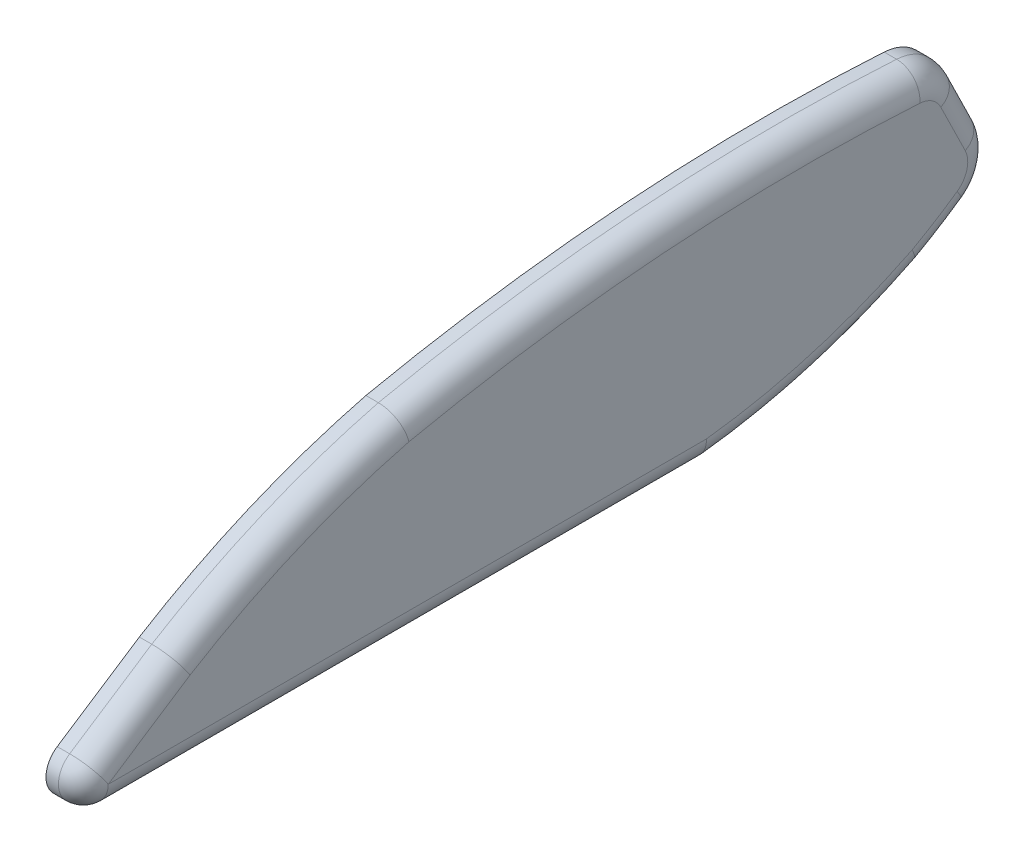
ISO-10303-21;
HEADER;
FILE_DESCRIPTION(('STEP AP214'),'2;1');
FILE_NAME('part.step','',(''),(''),'','','');
FILE_SCHEMA(('AUTOMOTIVE_DESIGN { 1 0 10303 214 1 1 1 1 }'));
ENDSEC;
DATA;
#1=APPLICATION_CONTEXT('core data for automotive mechanical design processes');
#2=APPLICATION_PROTOCOL_DEFINITION('international standard','automotive_design',2000,#1);
#3=PRODUCT_CONTEXT('',#1,'mechanical');
#4=PRODUCT('Part','Part','',(#3));
#5=PRODUCT_RELATED_PRODUCT_CATEGORY('part','',(#4));
#6=PRODUCT_DEFINITION_FORMATION('','',#4);
#7=PRODUCT_DEFINITION_CONTEXT('part definition',#1,'design');
#8=PRODUCT_DEFINITION('design','',#6,#7);
#9=PRODUCT_DEFINITION_SHAPE('','',#8);
#10=(LENGTH_UNIT() NAMED_UNIT(*) SI_UNIT(.MILLI.,.METRE.));
#11=(NAMED_UNIT(*) PLANE_ANGLE_UNIT() SI_UNIT($,.RADIAN.));
#12=(NAMED_UNIT(*) SI_UNIT($,.STERADIAN.) SOLID_ANGLE_UNIT());
#13=UNCERTAINTY_MEASURE_WITH_UNIT(LENGTH_MEASURE(1.E-05),#10,'distance_accuracy_value','');
#14=(GEOMETRIC_REPRESENTATION_CONTEXT(3) GLOBAL_UNCERTAINTY_ASSIGNED_CONTEXT((#13)) GLOBAL_UNIT_ASSIGNED_CONTEXT((#10,
#11,#12)) REPRESENTATION_CONTEXT('',''));
#15=CARTESIAN_POINT('',(0.,0.,0.));
#16=DIRECTION('',(0.,0.,1.));
#17=DIRECTION('',(1.,0.,0.));
#18=AXIS2_PLACEMENT_3D('',#15,#16,#17);
#19=CARTESIAN_POINT('',(15.,5142.50289528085,-13454.2735587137));
#20=DIRECTION('',(-1.,0.,0.));
#21=DIRECTION('',(0.,0.,1.));
#22=AXIS2_PLACEMENT_3D('',#19,#20,#21);
#23=CYLINDRICAL_SURFACE('',#22,9.99999999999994);
#24=DIRECTION('',(-1.,0.,0.));
#25=VECTOR('',#24,1.);
#26=CARTESIAN_POINT('',(15.,5132.50289528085,-13454.2735587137));
#27=LINE('',#26,#25);
#28=CARTESIAN_POINT('',(5.,5132.50289528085,-13454.2735587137));
#29=VERTEX_POINT('',#28);
#30=CARTESIAN_POINT('',(0.,5132.50289528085,-13454.2735587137));
#31=VERTEX_POINT('',#30);
#32=EDGE_CURVE('E138',#29,#31,#27,.T.);
#33=ORIENTED_EDGE('',*,*,#32,.F.);
#34=CARTESIAN_POINT('',(5.,5142.50289528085,-13454.2735587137));
#35=DIRECTION('',(-1.,0.,0.));
#36=DIRECTION('',(0.,0.,1.));
#37=AXIS2_PLACEMENT_3D('',#34,#35,#36);
#38=CIRCLE('',#37,9.99999999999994);
#39=CARTESIAN_POINT('',(5.,5150.86365337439,-13448.7874194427));
#40=VERTEX_POINT('',#39);
#41=EDGE_CURVE('E11',#29,#40,#38,.T.);
#42=ORIENTED_EDGE('',*,*,#41,.T.);
#43=DIRECTION('',(-1.,0.,0.));
#44=VECTOR('',#43,1.);
#45=CARTESIAN_POINT('',(15.,5150.86365337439,-13448.7874194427));
#46=LINE('',#45,#44);
#47=CARTESIAN_POINT('',(0.,5150.86365337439,-13448.7874194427));
#48=VERTEX_POINT('',#47);
#49=EDGE_CURVE('E159',#40,#48,#46,.T.);
#50=ORIENTED_EDGE('',*,*,#49,.T.);
#51=CARTESIAN_POINT('',(0.,5142.50289528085,-13454.2735587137));
#52=DIRECTION('',(1.,0.,0.));
#53=DIRECTION('',(0.,0.,-1.));
#54=AXIS2_PLACEMENT_3D('',#51,#52,#53);
#55=CIRCLE('',#54,9.99999999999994);
#56=EDGE_CURVE('E153',#48,#31,#55,.T.);
#57=ORIENTED_EDGE('',*,*,#56,.T.);
#58=EDGE_LOOP('',(#33,#42,#50,#57));
#59=FACE_BOUND('',#58,.T.);
#60=ADVANCED_FACE('F35',(#59),#23,.T.);
#61=CARTESIAN_POINT('',(15.,5132.50289528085,-13454.2735587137));
#62=DIRECTION('',(0.,1.,0.));
#63=DIRECTION('',(0.,0.,1.));
#64=AXIS2_PLACEMENT_3D('',#61,#62,#63);
#65=PLANE('',#64);
#66=DIRECTION('',(-1.,0.,0.));
#67=VECTOR('',#66,1.);
#68=CARTESIAN_POINT('',(15.,5132.50289528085,-13695.0821016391));
#69=LINE('',#68,#67);
#70=CARTESIAN_POINT('',(5.,5132.50289528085,-13695.0821016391));
#71=VERTEX_POINT('',#70);
#72=CARTESIAN_POINT('',(0.,5132.50289528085,-13695.0821016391));
#73=VERTEX_POINT('',#72);
#74=EDGE_CURVE('E147',#71,#73,#69,.T.);
#75=ORIENTED_EDGE('',*,*,#74,.F.);
#76=DIRECTION('',(0.,0.,-1.));
#77=VECTOR('',#76,1.);
#78=CARTESIAN_POINT('',(5.,5132.50289528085,-13454.2735587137));
#79=LINE('',#78,#77);
#80=EDGE_CURVE('E44',#71,#29,#79,.F.);
#81=ORIENTED_EDGE('',*,*,#80,.T.);
#82=ORIENTED_EDGE('',*,*,#32,.T.);
#83=DIRECTION('',(0.,0.,-1.));
#84=VECTOR('',#83,1.);
#85=CARTESIAN_POINT('',(0.,5132.50289528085,-13454.2735587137));
#86=LINE('',#85,#84);
#87=EDGE_CURVE('E141',#31,#73,#86,.T.);
#88=ORIENTED_EDGE('',*,*,#87,.T.);
#89=EDGE_LOOP('',(#75,#81,#82,#88));
#90=FACE_BOUND('',#89,.T.);
#91=ADVANCED_FACE('F140',(#90),#65,.F.);
#92=CARTESIAN_POINT('',(15.,5391.39881240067,-13665.8801747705));
#93=DIRECTION('',(-1.,0.,0.));
#94=DIRECTION('',(0.,0.,1.));
#95=AXIS2_PLACEMENT_3D('',#92,#93,#94);
#96=CYLINDRICAL_SURFACE('',#95,260.537614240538);
#97=DIRECTION('',(-1.,0.,0.));
#98=VECTOR('',#97,1.);
#99=CARTESIAN_POINT('',(15.,5158.06773013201,-13781.79589623));
#100=LINE('',#99,#98);
#101=CARTESIAN_POINT('',(5.,5158.06773013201,-13781.79589623));
#102=VERTEX_POINT('',#101);
#103=CARTESIAN_POINT('',(0.,5158.06773013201,-13781.79589623));
#104=VERTEX_POINT('',#103);
#105=EDGE_CURVE('E199',#102,#104,#100,.T.);
#106=ORIENTED_EDGE('',*,*,#105,.F.);
#107=CARTESIAN_POINT('',(5.,5391.39881240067,-13665.8801747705));
#108=DIRECTION('',(1.,0.,0.));
#109=DIRECTION('',(0.,0.,-1.));
#110=AXIS2_PLACEMENT_3D('',#107,#108,#109);
#111=CIRCLE('',#110,260.537614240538);
#112=EDGE_CURVE('E59',#102,#71,#111,.F.);
#113=ORIENTED_EDGE('',*,*,#112,.T.);
#114=ORIENTED_EDGE('',*,*,#74,.T.);
#115=CARTESIAN_POINT('',(0.,5391.39881240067,-13665.8801747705));
#116=DIRECTION('',(1.,0.,0.));
#117=DIRECTION('',(0.,0.,-1.));
#118=AXIS2_PLACEMENT_3D('',#115,#116,#117);
#119=CIRCLE('',#118,260.537614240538);
#120=EDGE_CURVE('E156',#73,#104,#119,.T.);
#121=ORIENTED_EDGE('',*,*,#120,.T.);
#122=EDGE_LOOP('',(#106,#113,#114,#121));
#123=FACE_BOUND('',#122,.T.);
#124=ADVANCED_FACE('F367',(#123),#96,.T.);
#125=CARTESIAN_POINT('',(15.,5346.77737093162,-13677.4696435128));
#126=DIRECTION('',(-1.,0.,0.));
#127=DIRECTION('',(0.,0.,1.));
#128=AXIS2_PLACEMENT_3D('',#125,#126,#127);
#129=CYLINDRICAL_SURFACE('',#128,215.627678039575);
#130=DIRECTION('',(-1.,0.,0.));
#131=VECTOR('',#130,1.);
#132=CARTESIAN_POINT('',(15.,5170.02673681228,-13800.9787884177));
#133=LINE('',#132,#131);
#134=CARTESIAN_POINT('',(5.,5170.02673681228,-13800.9787884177));
#135=VERTEX_POINT('',#134);
#136=CARTESIAN_POINT('',(0.,5170.02673681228,-13800.9787884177));
#137=VERTEX_POINT('',#136);
#138=EDGE_CURVE('E197',#135,#137,#133,.T.);
#139=ORIENTED_EDGE('',*,*,#138,.F.);
#140=CARTESIAN_POINT('',(5.,5346.77737093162,-13677.4696435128));
#141=DIRECTION('',(1.,0.,0.));
#142=DIRECTION('',(0.,0.,-1.));
#143=AXIS2_PLACEMENT_3D('',#140,#141,#142);
#144=CIRCLE('',#143,215.627678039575);
#145=EDGE_CURVE('E233',#135,#102,#144,.F.);
#146=ORIENTED_EDGE('',*,*,#145,.T.);
#147=ORIENTED_EDGE('',*,*,#105,.T.);
#148=CARTESIAN_POINT('',(0.,5346.77737093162,-13677.4696435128));
#149=DIRECTION('',(1.,0.,0.));
#150=DIRECTION('',(0.,0.,-1.));
#151=AXIS2_PLACEMENT_3D('',#148,#149,#150);
#152=CIRCLE('',#151,215.627678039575);
#153=EDGE_CURVE('E166',#104,#137,#152,.T.);
#154=ORIENTED_EDGE('',*,*,#153,.T.);
#155=EDGE_LOOP('',(#139,#146,#147,#154));
#156=FACE_BOUND('',#155,.T.);
#157=ADVANCED_FACE('F372',(#156),#129,.T.);
#158=CARTESIAN_POINT('',(15.,5186.42079491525,-13789.5230100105));
#159=DIRECTION('',(-1.,0.,0.));
#160=DIRECTION('',(0.,0.,1.));
#161=AXIS2_PLACEMENT_3D('',#158,#159,#160);
#162=CYLINDRICAL_SURFACE('',#161,20.0000000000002);
#163=DIRECTION('',(-1.,0.,0.));
#164=VECTOR('',#163,1.);
#165=CARTESIAN_POINT('',(15.,5195.2187907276,-13807.4839473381));
#166=LINE('',#165,#164);
#167=CARTESIAN_POINT('',(5.,5195.2187907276,-13807.4839473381));
#168=VERTEX_POINT('',#167);
#169=CARTESIAN_POINT('',(0.,5195.2187907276,-13807.4839473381));
#170=VERTEX_POINT('',#169);
#171=EDGE_CURVE('E195',#168,#170,#166,.T.);
#172=ORIENTED_EDGE('',*,*,#171,.F.);
#173=CARTESIAN_POINT('',(5.,5186.42079491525,-13789.5230100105));
#174=DIRECTION('',(1.,0.,0.));
#175=DIRECTION('',(0.,0.,-1.));
#176=AXIS2_PLACEMENT_3D('',#173,#174,#175);
#177=CIRCLE('',#176,20.0000000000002);
#178=EDGE_CURVE('E231',#168,#135,#177,.F.);
#179=ORIENTED_EDGE('',*,*,#178,.T.);
#180=ORIENTED_EDGE('',*,*,#138,.T.);
#181=CARTESIAN_POINT('',(0.,5186.42079491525,-13789.5230100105));
#182=DIRECTION('',(1.,0.,0.));
#183=DIRECTION('',(0.,0.,-1.));
#184=AXIS2_PLACEMENT_3D('',#181,#182,#183);
#185=CIRCLE('',#184,20.0000000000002);
#186=EDGE_CURVE('E169',#137,#170,#185,.T.);
#187=ORIENTED_EDGE('',*,*,#186,.T.);
#188=EDGE_LOOP('',(#172,#179,#180,#187));
#189=FACE_BOUND('',#188,.T.);
#190=ADVANCED_FACE('F375',(#189),#162,.T.);
#191=CARTESIAN_POINT('',(15.,5215.23278953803,-13797.6802787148));
#192=DIRECTION('',(0.,-0.439899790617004,0.898046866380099));
#193=DIRECTION('',(0.,-0.898046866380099,-0.439899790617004));
#194=AXIS2_PLACEMENT_3D('',#191,#192,#193);
#195=PLANE('',#194);
#196=DIRECTION('',(-1.,0.,0.));
#197=VECTOR('',#196,1.);
#198=CARTESIAN_POINT('',(15.,5215.23278953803,-13797.6802787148));
#199=LINE('',#198,#197);
#200=CARTESIAN_POINT('',(5.,5215.23278953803,-13797.6802787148));
#201=VERTEX_POINT('',#200);
#202=CARTESIAN_POINT('',(0.,5215.23278953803,-13797.6802787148));
#203=VERTEX_POINT('',#202);
#204=EDGE_CURVE('E193',#201,#203,#199,.T.);
#205=ORIENTED_EDGE('',*,*,#204,.F.);
#206=DIRECTION('',(0.,0.898046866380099,0.439899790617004));
#207=VECTOR('',#206,1.);
#208=CARTESIAN_POINT('',(5.,5195.2187907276,-13807.4839473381));
#209=LINE('',#208,#207);
#210=EDGE_CURVE('E229',#201,#168,#209,.F.);
#211=ORIENTED_EDGE('',*,*,#210,.T.);
#212=ORIENTED_EDGE('',*,*,#171,.T.);
#213=DIRECTION('',(0.,0.898046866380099,0.439899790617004));
#214=VECTOR('',#213,1.);
#215=CARTESIAN_POINT('',(0.,5215.23278953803,-13797.6802787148));
#216=LINE('',#215,#214);
#217=EDGE_CURVE('E172',#170,#203,#216,.T.);
#218=ORIENTED_EDGE('',*,*,#217,.T.);
#219=EDGE_LOOP('',(#205,#211,#212,#218));
#220=FACE_BOUND('',#219,.T.);
#221=ADVANCED_FACE('F351',(#220),#195,.F.);
#222=CARTESIAN_POINT('',(15.,5206.43479372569,-13779.7193413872));
#223=DIRECTION('',(-1.,0.,0.));
#224=DIRECTION('',(0.,0.,1.));
#225=AXIS2_PLACEMENT_3D('',#222,#223,#224);
#226=CYLINDRICAL_SURFACE('',#225,19.9999999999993);
#227=DIRECTION('',(-1.,0.,0.));
#228=VECTOR('',#227,1.);
#229=CARTESIAN_POINT('',(15.,5226.39702323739,-13780.9479149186));
#230=LINE('',#229,#228);
#231=CARTESIAN_POINT('',(5.,5226.39702323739,-13780.9479149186));
#232=VERTEX_POINT('',#231);
#233=CARTESIAN_POINT('',(0.,5226.39702323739,-13780.9479149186));
#234=VERTEX_POINT('',#233);
#235=EDGE_CURVE('E191',#232,#234,#230,.T.);
#236=ORIENTED_EDGE('',*,*,#235,.F.);
#237=CARTESIAN_POINT('',(5.,5206.43479372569,-13779.7193413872));
#238=DIRECTION('',(1.,0.,0.));
#239=DIRECTION('',(0.,0.,-1.));
#240=AXIS2_PLACEMENT_3D('',#237,#238,#239);
#241=CIRCLE('',#240,19.9999999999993);
#242=EDGE_CURVE('E227',#232,#201,#241,.F.);
#243=ORIENTED_EDGE('',*,*,#242,.T.);
#244=ORIENTED_EDGE('',*,*,#204,.T.);
#245=CARTESIAN_POINT('',(0.,5206.43479372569,-13779.7193413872));
#246=DIRECTION('',(1.,0.,0.));
#247=DIRECTION('',(0.,0.,-1.));
#248=AXIS2_PLACEMENT_3D('',#245,#246,#247);
#249=CIRCLE('',#248,19.9999999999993);
#250=EDGE_CURVE('E175',#203,#234,#249,.T.);
#251=ORIENTED_EDGE('',*,*,#250,.T.);
#252=EDGE_LOOP('',(#236,#243,#244,#251));
#253=FACE_BOUND('',#252,.T.);
#254=ADVANCED_FACE('F348',(#253),#226,.T.);
#255=CARTESIAN_POINT('',(15.,4453.86792841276,-13733.4026846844));
#256=DIRECTION('',(-1.,0.,0.));
#257=DIRECTION('',(0.,0.,1.));
#258=AXIS2_PLACEMENT_3D('',#255,#256,#257);
#259=CYLINDRICAL_SURFACE('',#258,773.990795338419);
#260=DIRECTION('',(-1.,0.,0.));
#261=VECTOR('',#260,1.);
#262=CARTESIAN_POINT('',(15.,5211.00677382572,-13572.7710563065));
#263=LINE('',#262,#261);
#264=CARTESIAN_POINT('',(5.,5211.00677382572,-13572.7710563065));
#265=VERTEX_POINT('',#264);
#266=CARTESIAN_POINT('',(0.,5211.00677382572,-13572.7710563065));
#267=VERTEX_POINT('',#266);
#268=EDGE_CURVE('E189',#265,#267,#263,.T.);
#269=ORIENTED_EDGE('',*,*,#268,.F.);
#270=CARTESIAN_POINT('',(5.,4453.86792841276,-13733.4026846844));
#271=DIRECTION('',(1.,0.,0.));
#272=DIRECTION('',(0.,0.,-1.));
#273=AXIS2_PLACEMENT_3D('',#270,#271,#272);
#274=CIRCLE('',#273,773.990795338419);
#275=EDGE_CURVE('E225',#265,#232,#274,.F.);
#276=ORIENTED_EDGE('',*,*,#275,.T.);
#277=ORIENTED_EDGE('',*,*,#235,.T.);
#278=CARTESIAN_POINT('',(0.,4453.86792841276,-13733.4026846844));
#279=DIRECTION('',(1.,0.,0.));
#280=DIRECTION('',(0.,0.,-1.));
#281=AXIS2_PLACEMENT_3D('',#278,#279,#280);
#282=CIRCLE('',#281,773.990795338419);
#283=EDGE_CURVE('E178',#234,#267,#282,.T.);
#284=ORIENTED_EDGE('',*,*,#283,.T.);
#285=EDGE_LOOP('',(#269,#276,#277,#284));
#286=FACE_BOUND('',#285,.T.);
#287=ADVANCED_FACE('F336',(#286),#259,.T.);
#288=CARTESIAN_POINT('',(15.,4894.62531357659,-13652.9812665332));
#289=DIRECTION('',(-1.,0.,0.));
#290=DIRECTION('',(0.,0.,1.));
#291=AXIS2_PLACEMENT_3D('',#288,#289,#290);
#292=CYLINDRICAL_SURFACE('',#291,326.390726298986);
#293=DIRECTION('',(-1.,0.,0.));
#294=VECTOR('',#293,1.);
#295=CARTESIAN_POINT('',(15.,5172.50289528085,-13481.7651580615));
#296=LINE('',#295,#294);
#297=CARTESIAN_POINT('',(5.,5172.50289528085,-13481.7651580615));
#298=VERTEX_POINT('',#297);
#299=CARTESIAN_POINT('',(0.,5172.50289528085,-13481.7651580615));
#300=VERTEX_POINT('',#299);
#301=EDGE_CURVE('E187',#298,#300,#296,.T.);
#302=ORIENTED_EDGE('',*,*,#301,.F.);
#303=CARTESIAN_POINT('',(5.,4894.62531357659,-13652.9812665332));
#304=DIRECTION('',(1.,0.,0.));
#305=DIRECTION('',(0.,0.,-1.));
#306=AXIS2_PLACEMENT_3D('',#303,#304,#305);
#307=CIRCLE('',#306,326.390726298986);
#308=EDGE_CURVE('E223',#298,#265,#307,.F.);
#309=ORIENTED_EDGE('',*,*,#308,.T.);
#310=ORIENTED_EDGE('',*,*,#268,.T.);
#311=CARTESIAN_POINT('',(0.,4894.62531357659,-13652.9812665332));
#312=DIRECTION('',(1.,0.,0.));
#313=DIRECTION('',(0.,0.,-1.));
#314=AXIS2_PLACEMENT_3D('',#311,#312,#313);
#315=CIRCLE('',#314,326.390726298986);
#316=EDGE_CURVE('E181',#267,#300,#315,.T.);
#317=ORIENTED_EDGE('',*,*,#316,.T.);
#318=EDGE_LOOP('',(#302,#309,#310,#317));
#319=FACE_BOUND('',#318,.T.);
#320=ADVANCED_FACE('F333',(#319),#292,.T.);
#321=CARTESIAN_POINT('',(15.,5150.86365337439,-13448.7874194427));
#322=DIRECTION('',(0.,-0.836075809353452,-0.548613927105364));
#323=DIRECTION('',(0.,0.548613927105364,-0.836075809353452));
#324=AXIS2_PLACEMENT_3D('',#321,#322,#323);
#325=PLANE('',#324);
#326=ORIENTED_EDGE('',*,*,#49,.F.);
#327=DIRECTION('',(0.,-0.548613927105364,0.836075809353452));
#328=VECTOR('',#327,1.);
#329=CARTESIAN_POINT('',(5.,5172.50289528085,-13481.7651580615));
#330=LINE('',#329,#328);
#331=EDGE_CURVE('E220',#40,#298,#330,.F.);
#332=ORIENTED_EDGE('',*,*,#331,.T.);
#333=ORIENTED_EDGE('',*,*,#301,.T.);
#334=DIRECTION('',(0.,-0.548613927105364,0.836075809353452));
#335=VECTOR('',#334,1.);
#336=CARTESIAN_POINT('',(0.,5150.86365337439,-13448.7874194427));
#337=LINE('',#336,#335);
#338=EDGE_CURVE('E184',#300,#48,#337,.T.);
#339=ORIENTED_EDGE('',*,*,#338,.T.);
#340=EDGE_LOOP('',(#326,#332,#333,#339));
#341=FACE_BOUND('',#340,.T.);
#342=ADVANCED_FACE('F323',(#341),#325,.F.);
#343=CARTESIAN_POINT('',(15.,5142.50289528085,-13454.2735587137));
#344=DIRECTION('',(1.,0.,0.));
#345=DIRECTION('',(0.,0.,-1.));
#346=AXIS2_PLACEMENT_3D('',#343,#344,#345);
#347=PLANE('',#346);
#348=CARTESIAN_POINT('',(15.,4894.62531357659,-13652.9812665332));
#349=DIRECTION('',(1.,0.,0.));
#350=DIRECTION('',(0.,0.,-1.));
#351=AXIS2_PLACEMENT_3D('',#348,#349,#350);
#352=CIRCLE('',#351,316.390726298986);
#353=CARTESIAN_POINT('',(15.,5201.26538139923,-13575.0392336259));
#354=VERTEX_POINT('',#353);
#355=CARTESIAN_POINT('',(15.,5164.06337161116,-13487.1312602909));
#356=VERTEX_POINT('',#355);
#357=EDGE_CURVE('E215',#354,#356,#352,.T.);
#358=ORIENTED_EDGE('',*,*,#357,.T.);
#359=DIRECTION('',(0.,-0.548613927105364,0.836075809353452));
#360=VECTOR('',#359,1.);
#361=CARTESIAN_POINT('',(15.,5142.50289528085,-13454.2735587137));
#362=LINE('',#361,#360);
#363=CARTESIAN_POINT('',(15.,5142.50289528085,-13454.2735587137));
#364=VERTEX_POINT('',#363);
#365=EDGE_CURVE('E217',#356,#364,#362,.T.);
#366=ORIENTED_EDGE('',*,*,#365,.T.);
#367=DIRECTION('',(0.,0.,-1.));
#368=VECTOR('',#367,1.);
#369=CARTESIAN_POINT('',(15.,5142.50289528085,-13695.0821016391));
#370=LINE('',#369,#368);
#371=CARTESIAN_POINT('',(15.,5142.50289528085,-13694.514395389));
#372=VERTEX_POINT('',#371);
#373=EDGE_CURVE('E146',#364,#372,#370,.T.);
#374=ORIENTED_EDGE('',*,*,#373,.T.);
#375=CARTESIAN_POINT('',(15.,5391.39881240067,-13665.8801747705));
#376=DIRECTION('',(1.,0.,0.));
#377=DIRECTION('',(0.,0.,-1.));
#378=AXIS2_PLACEMENT_3D('',#375,#376,#377);
#379=CIRCLE('',#378,250.537614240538);
#380=CARTESIAN_POINT('',(15.,5166.92558653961,-13777.1495192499));
#381=VERTEX_POINT('',#380);
#382=EDGE_CURVE('E203',#372,#381,#379,.T.);
#383=ORIENTED_EDGE('',*,*,#382,.T.);
#384=CARTESIAN_POINT('',(15.,5346.77737093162,-13677.4696435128));
#385=DIRECTION('',(1.,0.,0.));
#386=DIRECTION('',(0.,0.,-1.));
#387=AXIS2_PLACEMENT_3D('',#384,#385,#386);
#388=CIRCLE('',#387,205.627678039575);
#389=CARTESIAN_POINT('',(15.,5178.22376586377,-13795.2508992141));
#390=VERTEX_POINT('',#389);
#391=EDGE_CURVE('E205',#381,#390,#388,.T.);
#392=ORIENTED_EDGE('',*,*,#391,.T.);
#393=CARTESIAN_POINT('',(15.,5186.42079491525,-13789.5230100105));
#394=DIRECTION('',(1.,0.,0.));
#395=DIRECTION('',(0.,0.,-1.));
#396=AXIS2_PLACEMENT_3D('',#393,#394,#395);
#397=CIRCLE('',#396,10.0000000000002);
#398=CARTESIAN_POINT('',(15.,5190.81979282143,-13798.5034786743));
#399=VERTEX_POINT('',#398);
#400=EDGE_CURVE('E207',#390,#399,#397,.T.);
#401=ORIENTED_EDGE('',*,*,#400,.T.);
#402=DIRECTION('',(0.,0.898046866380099,0.439899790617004));
#403=VECTOR('',#402,1.);
#404=CARTESIAN_POINT('',(15.,5210.83379163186,-13788.699810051));
#405=LINE('',#404,#403);
#406=CARTESIAN_POINT('',(15.,5210.83379163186,-13788.699810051));
#407=VERTEX_POINT('',#406);
#408=EDGE_CURVE('E209',#399,#407,#405,.T.);
#409=ORIENTED_EDGE('',*,*,#408,.T.);
#410=CARTESIAN_POINT('',(15.,5206.43479372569,-13779.7193413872));
#411=DIRECTION('',(1.,0.,0.));
#412=DIRECTION('',(0.,0.,-1.));
#413=AXIS2_PLACEMENT_3D('',#410,#411,#412);
#414=CIRCLE('',#413,9.99999999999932);
#415=CARTESIAN_POINT('',(15.,5216.41590848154,-13780.3336281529));
#416=VERTEX_POINT('',#415);
#417=EDGE_CURVE('E211',#407,#416,#414,.T.);
#418=ORIENTED_EDGE('',*,*,#417,.T.);
#419=CARTESIAN_POINT('',(15.,4453.86792841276,-13733.4026846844));
#420=DIRECTION('',(1.,0.,0.));
#421=DIRECTION('',(0.,0.,-1.));
#422=AXIS2_PLACEMENT_3D('',#419,#420,#421);
#423=CIRCLE('',#422,763.990795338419);
#424=EDGE_CURVE('E213',#416,#354,#423,.T.);
#425=ORIENTED_EDGE('',*,*,#424,.T.);
#426=EDGE_LOOP('',(#358,#366,#374,#383,#392,#401,#409,#418,#425));
#427=FACE_BOUND('',#426,.T.);
#428=ADVANCED_FACE('F312',(#427),#347,.T.);
#429=CARTESIAN_POINT('',(0.,5142.50289528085,-13454.2735587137));
#430=DIRECTION('',(1.,0.,0.));
#431=DIRECTION('',(0.,0.,-1.));
#432=AXIS2_PLACEMENT_3D('',#429,#430,#431);
#433=PLANE('',#432);
#434=ORIENTED_EDGE('',*,*,#56,.F.);
#435=ORIENTED_EDGE('',*,*,#338,.F.);
#436=ORIENTED_EDGE('',*,*,#316,.F.);
#437=ORIENTED_EDGE('',*,*,#283,.F.);
#438=ORIENTED_EDGE('',*,*,#250,.F.);
#439=ORIENTED_EDGE('',*,*,#217,.F.);
#440=ORIENTED_EDGE('',*,*,#186,.F.);
#441=ORIENTED_EDGE('',*,*,#153,.F.);
#442=ORIENTED_EDGE('',*,*,#120,.F.);
#443=ORIENTED_EDGE('',*,*,#87,.F.);
#444=EDGE_LOOP('',(#434,#435,#436,#437,#438,#439,#440,#441,#442,#443));
#445=FACE_BOUND('',#444,.T.);
#446=ADVANCED_FACE('F151',(#445),#433,.F.);
#447=CARTESIAN_POINT('',(5.,5186.42079491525,-13789.5230100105));
#448=DIRECTION('',(1.,0.,0.));
#449=DIRECTION('',(0.,0.,-1.));
#450=AXIS2_PLACEMENT_3D('',#447,#448,#449);
#451=TOROIDAL_SURFACE('',#450,10.0000000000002,10.);
#452=CARTESIAN_POINT('',(5.,5178.22376586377,-13795.2508992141));
#453=DIRECTION('',(0.,-0.572788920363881,0.819702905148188));
#454=DIRECTION('',(0.,-0.819702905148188,-0.572788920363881));
#455=AXIS2_PLACEMENT_3D('',#452,#453,#454);
#456=CIRCLE('',#455,10.);
#457=EDGE_CURVE('E163',#135,#390,#456,.T.);
#458=ORIENTED_EDGE('',*,*,#457,.F.);
#459=ORIENTED_EDGE('',*,*,#178,.F.);
#460=CARTESIAN_POINT('',(5.,5190.81979282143,-13798.5034786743));
#461=DIRECTION('',(0.,0.898046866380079,0.439899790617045));
#462=DIRECTION('',(0.,-0.439899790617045,0.898046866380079));
#463=AXIS2_PLACEMENT_3D('',#460,#461,#462);
#464=CIRCLE('',#463,10.);
#465=EDGE_CURVE('E39',#399,#168,#464,.T.);
#466=ORIENTED_EDGE('',*,*,#465,.F.);
#467=ORIENTED_EDGE('',*,*,#400,.F.);
#468=EDGE_LOOP('',(#458,#459,#466,#467));
#469=FACE_BOUND('',#468,.T.);
#470=ADVANCED_FACE('F37',(#469),#451,.T.);
#471=CARTESIAN_POINT('',(5.,5287.84103256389,-13750.9785391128));
#472=DIRECTION('',(0.,-0.898046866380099,-0.439899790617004));
#473=DIRECTION('',(0.,0.439899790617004,-0.898046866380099));
#474=AXIS2_PLACEMENT_3D('',#471,#472,#473);
#475=CYLINDRICAL_SURFACE('',#474,10.);
#476=ORIENTED_EDGE('',*,*,#465,.T.);
#477=ORIENTED_EDGE('',*,*,#210,.F.);
#478=CARTESIAN_POINT('',(5.,5210.83379163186,-13788.699810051));
#479=DIRECTION('',(0.,0.898046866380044,0.439899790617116));
#480=DIRECTION('',(0.,-0.439899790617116,0.898046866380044));
#481=AXIS2_PLACEMENT_3D('',#478,#479,#480);
#482=CIRCLE('',#481,10.);
#483=EDGE_CURVE('E298',#407,#201,#482,.T.);
#484=ORIENTED_EDGE('',*,*,#483,.F.);
#485=ORIENTED_EDGE('',*,*,#408,.F.);
#486=EDGE_LOOP('',(#476,#477,#484,#485));
#487=FACE_BOUND('',#486,.T.);
#488=ADVANCED_FACE('F356',(#487),#475,.T.);
#489=CARTESIAN_POINT('',(5.,5346.77737093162,-13677.4696435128));
#490=DIRECTION('',(1.,0.,0.));
#491=DIRECTION('',(0.,0.,-1.));
#492=AXIS2_PLACEMENT_3D('',#489,#490,#491);
#493=TOROIDAL_SURFACE('',#492,205.627678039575,10.);
#494=ORIENTED_EDGE('',*,*,#457,.T.);
#495=ORIENTED_EDGE('',*,*,#391,.F.);
#496=CARTESIAN_POINT('',(5.,5158.06773013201,-13781.79589623));
#497=CARTESIAN_POINT('',(5.28120132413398,5158.06770331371,-13781.795910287));
#498=CARTESIAN_POINT('',(5.56239827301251,5158.07823556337,-13781.7903862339));
#499=CARTESIAN_POINT('',(6.12278007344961,5158.12022448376,-13781.7683634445));
#500=CARTESIAN_POINT('',(6.40196502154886,5158.15168014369,-13781.7518652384));
#501=CARTESIAN_POINT('',(6.95615397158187,5158.23529307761,-13781.7080109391));
#502=CARTESIAN_POINT('',(7.231160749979,5158.28743591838,-13781.680662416));
#503=CARTESIAN_POINT('',(7.77523594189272,5158.41204327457,-13781.6153066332));
#504=CARTESIAN_POINT('',(8.04430442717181,5158.48450754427,-13781.5772995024));
#505=CARTESIAN_POINT('',(8.5747195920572,5158.64928349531,-13781.4908750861));
#506=CARTESIAN_POINT('',(8.83606258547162,5158.74160448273,-13781.4424529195));
#507=CARTESIAN_POINT('',(9.34904236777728,5158.94541801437,-13781.3355527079));
#508=CARTESIAN_POINT('',(9.60067895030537,5159.05691096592,-13781.2770744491));
#509=CARTESIAN_POINT('',(10.0923925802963,5159.29824463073,-13781.1504938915));
#510=CARTESIAN_POINT('',(10.3324723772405,5159.4280809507,-13781.082393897));
#511=CARTESIAN_POINT('',(10.7994301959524,5159.7051969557,-13780.9370439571));
#512=CARTESIAN_POINT('',(11.0263082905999,5159.85247654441,-13780.8597940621));
#513=CARTESIAN_POINT('',(11.465267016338,5160.16344208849,-13780.696687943));
#514=CARTESIAN_POINT('',(11.6773467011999,5160.32712909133,-13780.6108311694));
#515=CARTESIAN_POINT('',(12.0851868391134,5160.66973752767,-13780.4311256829));
#516=CARTESIAN_POINT('',(12.2809472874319,5160.84865896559,-13780.3372769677));
#517=CARTESIAN_POINT('',(12.6548206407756,5161.22052520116,-13780.1422225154));
#518=CARTESIAN_POINT('',(12.8329277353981,5161.41347457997,-13780.041014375));
#519=CARTESIAN_POINT('',(13.1701534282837,5161.81196861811,-13779.8319898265));
#520=CARTESIAN_POINT('',(13.3292723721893,5162.01751304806,-13779.7241735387));
#521=CARTESIAN_POINT('',(13.6274700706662,5162.43984403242,-13779.5026421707));
#522=CARTESIAN_POINT('',(13.7665388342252,5162.65663611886,-13779.3889241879));
#523=CARTESIAN_POINT('',(14.0235515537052,5163.09982072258,-13779.1564502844));
#524=CARTESIAN_POINT('',(14.1414958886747,5163.32621306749,-13779.0376944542));
#525=CARTESIAN_POINT('',(14.3553555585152,5163.78684378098,-13778.7960648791));
#526=CARTESIAN_POINT('',(14.4512853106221,5164.02107689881,-13778.6731938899));
#527=CARTESIAN_POINT('',(14.6205071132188,5164.4957809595,-13778.4241773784));
#528=CARTESIAN_POINT('',(14.6938058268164,5164.73625004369,-13778.2980328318));
#529=CARTESIAN_POINT('',(14.8333338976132,5165.28491397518,-13778.0102135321));
#530=CARTESIAN_POINT('',(14.8927804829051,5165.59447481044,-13777.8478214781));
#531=CARTESIAN_POINT('',(14.9742151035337,5166.21701328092,-13777.5212407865));
#532=CARTESIAN_POINT('',(14.996263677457,5166.52998456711,-13777.3570554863));
#533=CARTESIAN_POINT('',(14.9998550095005,5166.87046239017,-13777.1784379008));
#534=CARTESIAN_POINT('',(15.0000002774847,5166.89802537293,-13777.1639781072));
#535=CARTESIAN_POINT('',(15.,5166.92558653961,-13777.1495192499));
#536=B_SPLINE_CURVE_WITH_KNOTS('',3,(#496,#497,#498,#499,#500,#501,#502,#503,#504,#505,#506,
#507,#508,#509,#510,#511,#512,#513,#514,#515,#516,#517,#518,#519,#520,#521,#522,#523,#524,#525,
#526,#527,#528,#529,#530,#531,#532,#533,#534,#535),.UNSPECIFIED.,.F.,.F.,(4,2,2,2,2,2,2,2,2,2,2,
2,2,2,2,2,2,2,2,4),(0.,0.843346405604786,1.68665207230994,2.52937040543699,3.37207854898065,
4.21518250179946,5.05830436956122,5.90122464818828,6.74414027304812,7.58710974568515,
8.43007946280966,9.27332571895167,10.1165566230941,10.9602062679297,11.8038407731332,
12.6469211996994,13.4897531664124,14.5515301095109,15.6115866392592,15.7049629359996),.UNSPECIFIED.);
#537=EDGE_CURVE('E292',#102,#381,#536,.T.);
#538=ORIENTED_EDGE('',*,*,#537,.F.);
#539=ORIENTED_EDGE('',*,*,#145,.F.);
#540=EDGE_LOOP('',(#494,#495,#538,#539));
#541=FACE_BOUND('',#540,.T.);
#542=ADVANCED_FACE('F288',(#541),#493,.T.);
#543=CARTESIAN_POINT('',(5.,5206.43479372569,-13779.7193413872));
#544=DIRECTION('',(1.,0.,0.));
#545=DIRECTION('',(0.,0.,-1.));
#546=AXIS2_PLACEMENT_3D('',#543,#544,#545);
#547=DEGENERATE_TOROIDAL_SURFACE('',#546,9.99999999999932,10.,.T.);
#548=ORIENTED_EDGE('',*,*,#483,.T.);
#549=ORIENTED_EDGE('',*,*,#242,.F.);
#550=CARTESIAN_POINT('',(5.,5216.41590848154,-13780.3336281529));
#551=DIRECTION('',(0.,0.0614286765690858,0.998111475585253));
#552=DIRECTION('',(0.,-0.998111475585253,0.0614286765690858));
#553=AXIS2_PLACEMENT_3D('',#550,#551,#552);
#554=CIRCLE('',#553,10.);
#555=EDGE_CURVE('E281',#416,#232,#554,.T.);
#556=ORIENTED_EDGE('',*,*,#555,.F.);
#557=ORIENTED_EDGE('',*,*,#417,.F.);
#558=EDGE_LOOP('',(#548,#549,#556,#557));
#559=FACE_BOUND('',#558,.T.);
#560=ADVANCED_FACE('F286',(#559),#547,.T.);
#561=CARTESIAN_POINT('',(5.,5391.39881240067,-13665.8801747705));
#562=DIRECTION('',(1.,0.,0.));
#563=DIRECTION('',(0.,0.,-1.));
#564=AXIS2_PLACEMENT_3D('',#561,#562,#563);
#565=TOROIDAL_SURFACE('',#564,250.537614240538,10.);
#566=ORIENTED_EDGE('',*,*,#537,.T.);
#567=ORIENTED_EDGE('',*,*,#382,.F.);
#568=CARTESIAN_POINT('',(5.,5132.50289528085,-13695.0821016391));
#569=CARTESIAN_POINT('',(5.28092738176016,5132.5028648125,-13695.0821032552));
#570=CARTESIAN_POINT('',(5.56185025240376,5132.51473202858,-13695.0814361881));
#571=CARTESIAN_POINT('',(6.12168378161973,5132.56204166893,-13695.0787763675));
#572=CARTESIAN_POINT('',(6.40059454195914,5132.59748289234,-13695.0767836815));
#573=CARTESIAN_POINT('',(6.95422611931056,5132.69168579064,-13695.0714862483));
#574=CARTESIAN_POINT('',(7.22894986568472,5132.75043030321,-13695.0681824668));
#575=CARTESIAN_POINT('',(7.77246308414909,5132.89080840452,-13695.0602857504));
#576=CARTESIAN_POINT('',(8.0412526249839,5132.97244172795,-13695.0556928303));
#577=CARTESIAN_POINT('',(8.57111303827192,5133.15805756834,-13695.0452464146));
#578=CARTESIAN_POINT('',(8.83218034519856,5133.26205023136,-13695.0393923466));
#579=CARTESIAN_POINT('',(9.3446212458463,5133.49161947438,-13695.0264644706));
#580=CARTESIAN_POINT('',(9.59599462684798,5133.61719652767,-13695.0193906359));
#581=CARTESIAN_POINT('',(10.0872035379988,5133.88900337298,-13695.0040730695));
#582=CARTESIAN_POINT('',(10.3270416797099,5134.03522846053,-13694.9958296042));
#583=CARTESIAN_POINT('',(10.7935427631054,5134.34730725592,-13694.9782276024));
#584=CARTESIAN_POINT('',(11.0202057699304,5134.51316086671,-13694.9688690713));
#585=CARTESIAN_POINT('',(11.4588994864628,5134.86342843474,-13694.9490940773));
#586=CARTESIAN_POINT('',(11.6709205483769,5135.04785443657,-13694.9386769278));
#587=CARTESIAN_POINT('',(12.0786702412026,5135.43386117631,-13694.9168607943));
#588=CARTESIAN_POINT('',(12.2743988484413,5135.63544193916,-13694.905461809));
#589=CARTESIAN_POINT('',(12.6482422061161,5136.05438887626,-13694.8817561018));
#590=CARTESIAN_POINT('',(12.8263513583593,5136.27176002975,-13694.8694490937));
#591=CARTESIAN_POINT('',(13.1636275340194,5136.72068066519,-13694.8440150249));
#592=CARTESIAN_POINT('',(13.3227948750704,5136.95222990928,-13694.830887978));
#593=CARTESIAN_POINT('',(13.6213312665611,5137.42827997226,-13694.8038801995));
#594=CARTESIAN_POINT('',(13.7606653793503,5137.67280262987,-13694.789998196));
#595=CARTESIAN_POINT('',(14.0182212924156,5138.17268287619,-13694.7615976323));
#596=CARTESIAN_POINT('',(14.1364434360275,5138.42804028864,-13694.7470790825));
#597=CARTESIAN_POINT('',(14.3508832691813,5138.94762895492,-13694.7175142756));
#598=CARTESIAN_POINT('',(14.4471140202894,5139.21185483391,-13694.702468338));
#599=CARTESIAN_POINT('',(14.6169585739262,5139.74735519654,-13694.6719504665));
#600=CARTESIAN_POINT('',(14.6905788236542,5140.01862764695,-13694.6564786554));
#601=CARTESIAN_POINT('',(14.8326466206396,5140.6454787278,-13694.6206971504));
#602=CARTESIAN_POINT('',(14.8934721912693,5141.00279793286,-13694.6002796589));
#603=CARTESIAN_POINT('',(14.9759614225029,5141.72141237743,-13694.5591728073));
#604=CARTESIAN_POINT('',(14.997690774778,5142.08269991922,-13694.5384839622));
#605=CARTESIAN_POINT('',(14.9999419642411,5142.46352092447,-13694.5166527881));
#606=CARTESIAN_POINT('',(15.0000001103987,5142.48320852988,-13694.5155240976));
#607=CARTESIAN_POINT('',(15.,5142.50289528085,-13694.514395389));
#608=B_SPLINE_CURVE_WITH_KNOTS('',3,(#568,#569,#570,#571,#572,#573,#574,#575,#576,#577,#578,
#579,#580,#581,#582,#583,#584,#585,#586,#587,#588,#589,#590,#591,#592,#593,#594,#595,#596,#597,
#598,#599,#600,#601,#602,#603,#604,#605,#606,#607),.UNSPECIFIED.,.F.,.F.,(4,2,2,2,2,2,2,2,2,2,2,
2,2,2,2,2,2,2,2,4),(0.,0.842524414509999,1.68500591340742,2.52686809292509,3.3687205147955,
4.21095575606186,5.05320946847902,5.89527158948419,6.73732954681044,7.57993715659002,
8.42254599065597,9.26542169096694,10.1082832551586,10.9526116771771,11.7969263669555,
12.6407382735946,13.4843093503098,14.5712873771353,15.6564372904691,15.7155969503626),.UNSPECIFIED.);
#609=EDGE_CURVE('E275',#71,#372,#608,.T.);
#610=ORIENTED_EDGE('',*,*,#609,.F.);
#611=ORIENTED_EDGE('',*,*,#112,.F.);
#612=EDGE_LOOP('',(#566,#567,#610,#611));
#613=FACE_BOUND('',#612,.T.);
#614=ADVANCED_FACE('F265',(#613),#565,.T.);
#615=CARTESIAN_POINT('',(5.,4453.86792841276,-13733.4026846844));
#616=DIRECTION('',(1.,0.,0.));
#617=DIRECTION('',(0.,0.,-1.));
#618=AXIS2_PLACEMENT_3D('',#615,#616,#617);
#619=TOROIDAL_SURFACE('',#618,763.990795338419,10.);
#620=ORIENTED_EDGE('',*,*,#555,.T.);
#621=ORIENTED_EDGE('',*,*,#275,.F.);
#622=CARTESIAN_POINT('',(5.,5211.00677382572,-13572.7710563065));
#623=CARTESIAN_POINT('',(5.28121168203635,5211.00680331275,-13572.7710494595));
#624=CARTESIAN_POINT('',(5.56241899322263,5210.99521963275,-13572.7737454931));
#625=CARTESIAN_POINT('',(6.12282151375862,5210.949038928,-13572.7844938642));
#626=CARTESIAN_POINT('',(6.40201681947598,5210.91444301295,-13572.7925459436));
#627=CARTESIAN_POINT('',(6.95622682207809,5210.82248275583,-13572.8139495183));
#628=CARTESIAN_POINT('',(7.23124428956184,5210.76513425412,-13572.8272973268));
#629=CARTESIAN_POINT('',(7.77534069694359,5210.62808658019,-13572.8591953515));
#630=CARTESIAN_POINT('',(8.04441970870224,5210.54838767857,-13572.8777455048));
#631=CARTESIAN_POINT('',(8.57485581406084,5210.36716061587,-13572.9199271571));
#632=CARTESIAN_POINT('',(8.83620921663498,5210.26562220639,-13572.9435610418));
#633=CARTESIAN_POINT('',(9.34920935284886,5210.04145932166,-13572.9957375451));
#634=CARTESIAN_POINT('',(9.60085588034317,5209.91883439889,-13573.0242802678));
#635=CARTESIAN_POINT('',(10.092588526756,5209.65340445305,-13573.086064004));
#636=CARTESIAN_POINT('',(10.332677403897,5209.51060427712,-13573.1193038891));
#637=CARTESIAN_POINT('',(10.7996524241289,5209.20581828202,-13573.1902509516));
#638=CARTESIAN_POINT('',(11.0265386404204,5209.04383256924,-13573.2279581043));
#639=CARTESIAN_POINT('',(11.4655077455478,5208.70181944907,-13573.3075739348));
#640=CARTESIAN_POINT('',(11.6775899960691,5208.52179126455,-13573.3494827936));
#641=CARTESIAN_POINT('',(12.0854342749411,5208.14497916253,-13573.4372032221));
#642=CARTESIAN_POINT('',(12.2811962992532,5207.94819524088,-13573.4830147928));
#643=CARTESIAN_POINT('',(12.6550718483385,5207.53920309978,-13573.5782312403));
#644=CARTESIAN_POINT('',(12.8331795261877,5207.32698981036,-13573.6276372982));
#645=CARTESIAN_POINT('',(13.1704045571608,5206.88870991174,-13573.7296775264));
#646=CARTESIAN_POINT('',(13.3295222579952,5206.66264355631,-13573.7823116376));
#647=CARTESIAN_POINT('',(13.6277087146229,5206.19815596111,-13573.8904596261));
#648=CARTESIAN_POINT('',(13.7667683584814,5205.95972917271,-13573.9459747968));
#649=CARTESIAN_POINT('',(14.0237620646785,5205.47231711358,-13574.0594671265));
#650=CARTESIAN_POINT('',(14.1416965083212,5205.22333203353,-13574.1174442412));
#651=CARTESIAN_POINT('',(14.355534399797,5204.71673520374,-13574.2354110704));
#652=CARTESIAN_POINT('',(14.4514524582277,5204.45912930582,-13574.2953994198));
#653=CARTESIAN_POINT('',(14.6206498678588,5203.93705758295,-13574.4169776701));
#654=CARTESIAN_POINT('',(14.6939359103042,5203.67259381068,-13574.4785670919));
#655=CARTESIAN_POINT('',(14.8331741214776,5203.07030824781,-13574.6188346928));
#656=CARTESIAN_POINT('',(14.8924655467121,5202.73101161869,-13574.6978575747));
#657=CARTESIAN_POINT('',(14.9738398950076,5202.04867372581,-13574.8567825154));
#658=CARTESIAN_POINT('',(14.9959825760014,5201.70563937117,-13574.9366829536));
#659=CARTESIAN_POINT('',(14.9998341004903,5201.33022736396,-13575.0241287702));
#660=CARTESIAN_POINT('',(15.0000003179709,5201.29780324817,-13575.0316814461));
#661=CARTESIAN_POINT('',(15.,5201.26538139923,-13575.0392336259));
#662=B_SPLINE_CURVE_WITH_KNOTS('',3,(#622,#623,#624,#625,#626,#627,#628,#629,#630,#631,#632,
#633,#634,#635,#636,#637,#638,#639,#640,#641,#642,#643,#644,#645,#646,#647,#648,#649,#650,#651,
#652,#653,#654,#655,#656,#657,#658,#659,#660,#661),.UNSPECIFIED.,.F.,.F.,(4,2,2,2,2,2,2,2,2,2,2,
2,2,2,2,2,2,2,2,4),(0.,0.843377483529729,1.68671430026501,2.52946501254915,3.37220552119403,
4.21534235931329,5.05849709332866,5.90144960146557,6.74439743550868,7.5873815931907,
8.43036595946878,9.27362858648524,10.1168757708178,10.9605048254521,11.8041186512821,
12.6471710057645,13.4899738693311,14.5481656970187,15.6046536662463,15.7045294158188),.UNSPECIFIED.);
#663=EDGE_CURVE('E269',#354,#265,#662,.F.);
#664=ORIENTED_EDGE('',*,*,#663,.F.);
#665=ORIENTED_EDGE('',*,*,#424,.F.);
#666=EDGE_LOOP('',(#620,#621,#664,#665));
#667=FACE_BOUND('',#666,.T.);
#668=ADVANCED_FACE('F260',(#667),#619,.T.);
#669=CARTESIAN_POINT('',(5.,5142.50289528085,-13454.2735587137));
#670=DIRECTION('',(0.,0.,1.));
#671=DIRECTION('',(0.,-1.,0.));
#672=AXIS2_PLACEMENT_3D('',#669,#670,#671);
#673=CYLINDRICAL_SURFACE('',#672,10.);
#674=ORIENTED_EDGE('',*,*,#609,.T.);
#675=ORIENTED_EDGE('',*,*,#373,.F.);
#676=CARTESIAN_POINT('',(5.,5142.50289528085,-13454.2735587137));
#677=DIRECTION('',(0.,0.,1.));
#678=DIRECTION('',(1.,0.,0.));
#679=AXIS2_PLACEMENT_3D('',#676,#677,#678);
#680=CIRCLE('',#679,10.);
#681=EDGE_CURVE('E246',#29,#364,#680,.T.);
#682=ORIENTED_EDGE('',*,*,#681,.F.);
#683=ORIENTED_EDGE('',*,*,#80,.F.);
#684=EDGE_LOOP('',(#674,#675,#682,#683));
#685=FACE_BOUND('',#684,.T.);
#686=ADVANCED_FACE('F264',(#685),#673,.T.);
#687=CARTESIAN_POINT('',(5.,4894.62531357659,-13652.9812665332));
#688=DIRECTION('',(1.,0.,0.));
#689=DIRECTION('',(0.,0.,-1.));
#690=AXIS2_PLACEMENT_3D('',#687,#688,#689);
#691=TOROIDAL_SURFACE('',#690,316.390726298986,10.);
#692=ORIENTED_EDGE('',*,*,#663,.T.);
#693=ORIENTED_EDGE('',*,*,#308,.F.);
#694=CARTESIAN_POINT('',(5.,5172.50289528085,-13481.7651580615));
#695=CARTESIAN_POINT('',(5.2812303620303,5172.50292080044,-13481.7651418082));
#696=CARTESIAN_POINT('',(5.56245636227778,5172.49288477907,-13481.771524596));
#697=CARTESIAN_POINT('',(6.12289626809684,5172.45287398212,-13481.7969708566));
#698=CARTESIAN_POINT('',(6.4021102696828,5172.42290016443,-13481.8160337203));
#699=CARTESIAN_POINT('',(6.95635840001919,5172.34322564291,-13481.8667052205));
#700=CARTESIAN_POINT('',(7.23139528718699,5172.29353860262,-13481.8983051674));
#701=CARTESIAN_POINT('',(7.77553024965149,5172.17479920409,-13481.9738205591));
#702=CARTESIAN_POINT('',(8.04462839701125,5172.10574708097,-13482.0177358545));
#703=CARTESIAN_POINT('',(8.57510262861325,5171.94872868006,-13482.1175945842));
#704=CARTESIAN_POINT('',(8.83647501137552,5171.86075349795,-13482.1735436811));
#705=CARTESIAN_POINT('',(9.34951224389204,5171.66653237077,-13482.297060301));
#706=CARTESIAN_POINT('',(9.6011768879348,5171.56028603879,-13482.3646280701));
#707=CARTESIAN_POINT('',(10.0929440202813,5171.33030713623,-13482.5108824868));
#708=CARTESIAN_POINT('',(10.3330492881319,5171.20657879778,-13482.5895664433));
#709=CARTESIAN_POINT('',(10.800055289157,5170.94249671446,-13482.7575050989));
#710=CARTESIAN_POINT('',(11.0269560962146,5170.80214306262,-13482.8467597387));
#711=CARTESIAN_POINT('',(11.4659428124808,5170.50580704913,-13483.0352051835));
#712=CARTESIAN_POINT('',(11.6780286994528,5170.34982466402,-13483.1343960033));
#713=CARTESIAN_POINT('',(12.0858784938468,5170.02333983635,-13483.3420080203));
#714=CARTESIAN_POINT('',(12.281642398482,5169.85283739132,-13483.4504292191));
#715=CARTESIAN_POINT('',(12.6555203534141,5169.49846448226,-13483.6757686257));
#716=CARTESIAN_POINT('',(12.8336284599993,5169.31458955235,-13483.7926896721));
#717=CARTESIAN_POINT('',(13.1708510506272,5168.9348332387,-13484.0341622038));
#718=CARTESIAN_POINT('',(13.3299658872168,5168.73895207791,-13484.1587135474));
#719=CARTESIAN_POINT('',(13.62813115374,5168.33649682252,-13484.4146107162));
#720=CARTESIAN_POINT('',(13.7671740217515,5168.12991873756,-13484.5459590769));
#721=CARTESIAN_POINT('',(14.0241328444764,5167.7076117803,-13484.8144690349));
#722=CARTESIAN_POINT('',(14.1420491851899,5167.49188307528,-13484.9516305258));
#723=CARTESIAN_POINT('',(14.3558466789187,5167.05295358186,-13485.2306987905));
#724=CARTESIAN_POINT('',(14.4517429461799,5166.82975803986,-13485.3726022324));
#725=CARTESIAN_POINT('',(14.6208955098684,5166.3774208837,-13485.6601836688));
#726=CARTESIAN_POINT('',(14.6941585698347,5166.14828106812,-13485.8058605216));
#727=CARTESIAN_POINT('',(14.8326592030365,5165.62900607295,-13486.1359854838));
#728=CARTESIAN_POINT('',(14.8915559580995,5165.3376542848,-13486.3212053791));
#729=CARTESIAN_POINT('',(14.9727986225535,5164.75173020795,-13486.6936826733));
#730=CARTESIAN_POINT('',(14.9952022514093,5164.45716374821,-13486.8809363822));
#731=CARTESIAN_POINT('',(14.9997700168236,5164.12952258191,-13487.0892099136));
#732=CARTESIAN_POINT('',(15.0000004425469,5164.09644578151,-13487.1102359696));
#733=CARTESIAN_POINT('',(15.,5164.06337161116,-13487.1312602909));
#734=B_SPLINE_CURVE_WITH_KNOTS('',3,(#694,#695,#696,#697,#698,#699,#700,#701,#702,#703,#704,
#705,#706,#707,#708,#709,#710,#711,#712,#713,#714,#715,#716,#717,#718,#719,#720,#721,#722,#723,
#724,#725,#726,#727,#728,#729,#730,#731,#732,#733),.UNSPECIFIED.,.F.,.F.,(4,2,2,2,2,2,2,2,2,2,2,
2,2,2,2,2,2,2,2,4),(0.,0.843433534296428,1.68682654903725,2.52963601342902,3.37243524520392,
4.21563193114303,5.05884647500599,5.90185723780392,6.74486328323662,7.5878705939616,
8.43087804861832,9.27416833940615,10.1174429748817,10.9610344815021,11.8046105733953,
12.6476059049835,13.4903490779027,14.539121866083,15.5862342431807,15.7038151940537),.UNSPECIFIED.);
#735=EDGE_CURVE('E239',#356,#298,#734,.F.);
#736=ORIENTED_EDGE('',*,*,#735,.F.);
#737=ORIENTED_EDGE('',*,*,#357,.F.);
#738=EDGE_LOOP('',(#692,#693,#736,#737));
#739=FACE_BOUND('',#738,.T.);
#740=ADVANCED_FACE('F248',(#739),#691,.T.);
#741=CARTESIAN_POINT('',(5.,5142.50289528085,-13454.2735587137));
#742=DIRECTION('',(0.,0.,1.));
#743=DIRECTION('',(1.,0.,0.));
#744=AXIS2_PLACEMENT_3D('',#741,#742,#743);
#745=SPHERICAL_SURFACE('',#744,10.);
#746=ORIENTED_EDGE('',*,*,#41,.F.);
#747=ORIENTED_EDGE('',*,*,#681,.T.);
#748=CARTESIAN_POINT('',(5.,5142.50289528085,-13454.2735587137));
#749=DIRECTION('',(0.,0.548613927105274,-0.836075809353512));
#750=DIRECTION('',(0.,0.836075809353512,0.548613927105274));
#751=AXIS2_PLACEMENT_3D('',#748,#749,#750);
#752=CIRCLE('',#751,10.);
#753=EDGE_CURVE('E237',#40,#364,#752,.T.);
#754=ORIENTED_EDGE('',*,*,#753,.F.);
#755=EDGE_LOOP('',(#746,#747,#754));
#756=FACE_BOUND('',#755,.T.);
#757=ADVANCED_FACE('F255',(#756),#745,.T.);
#758=CARTESIAN_POINT('',(5.,5142.50289528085,-13454.2735587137));
#759=DIRECTION('',(0.,0.548613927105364,-0.836075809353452));
#760=DIRECTION('',(0.,0.836075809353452,0.548613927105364));
#761=AXIS2_PLACEMENT_3D('',#758,#759,#760);
#762=CYLINDRICAL_SURFACE('',#761,10.);
#763=ORIENTED_EDGE('',*,*,#735,.T.);
#764=ORIENTED_EDGE('',*,*,#331,.F.);
#765=ORIENTED_EDGE('',*,*,#753,.T.);
#766=ORIENTED_EDGE('',*,*,#365,.F.);
#767=EDGE_LOOP('',(#763,#764,#765,#766));
#768=FACE_BOUND('',#767,.T.);
#769=ADVANCED_FACE('F251',(#768),#762,.T.);
#770=CLOSED_SHELL('',(#60,#91,#124,#157,#190,#221,#254,#287,#320,#342,#428,#446,#470,#488,#542,
#560,#614,#668,#686,#740,#757,#769));
#771=MANIFOLD_SOLID_BREP('B2',#770);
#772=ADVANCED_BREP_SHAPE_REPRESENTATION('',(#18,#771),#14);
#773=SHAPE_DEFINITION_REPRESENTATION(#9,#772);
ENDSEC;
END-ISO-10303-21;
